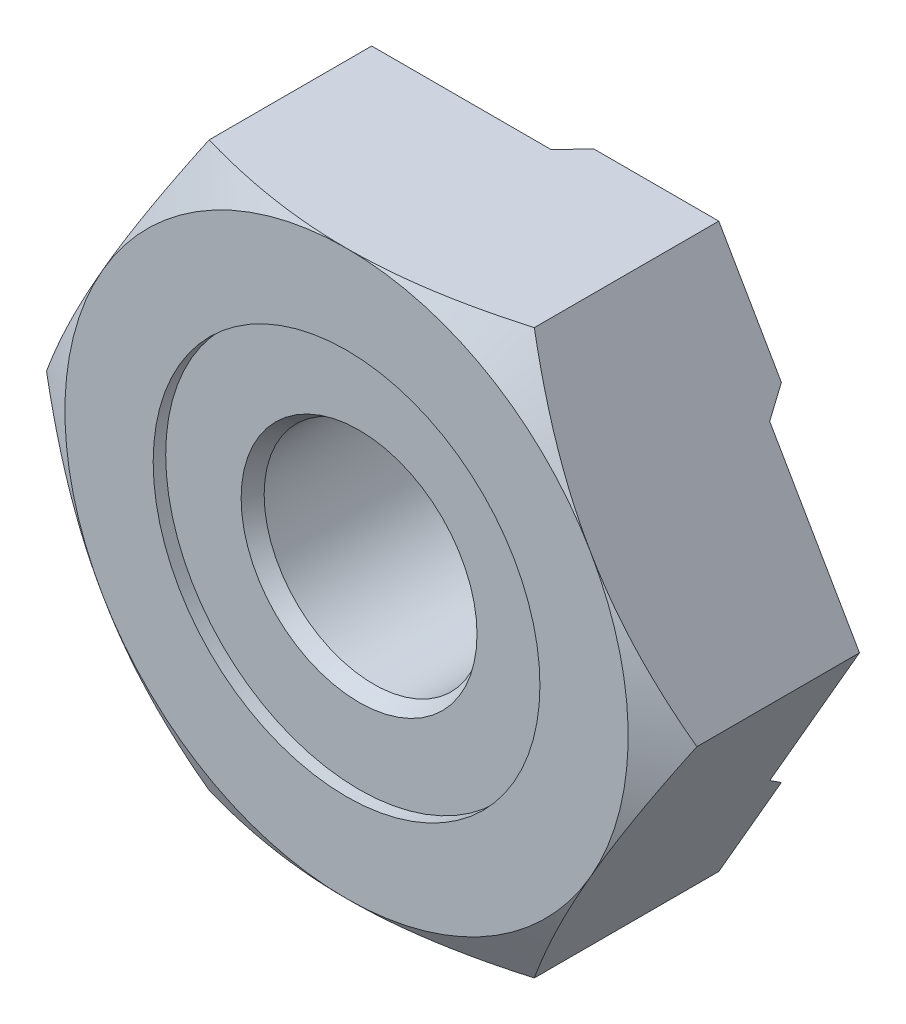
ISO-10303-21;
HEADER;
FILE_DESCRIPTION(('STEP AP214'),'2;1');
FILE_NAME('part.step','',(''),(''),'','','');
FILE_SCHEMA(('AUTOMOTIVE_DESIGN { 1 0 10303 214 1 1 1 1 }'));
ENDSEC;
DATA;
#1=APPLICATION_CONTEXT('core data for automotive mechanical design processes');
#2=APPLICATION_PROTOCOL_DEFINITION('international standard','automotive_design',2000,#1);
#3=PRODUCT_CONTEXT('',#1,'mechanical');
#4=PRODUCT('Part','Part','',(#3));
#5=PRODUCT_RELATED_PRODUCT_CATEGORY('part','',(#4));
#6=PRODUCT_DEFINITION_FORMATION('','',#4);
#7=PRODUCT_DEFINITION_CONTEXT('part definition',#1,'design');
#8=PRODUCT_DEFINITION('design','',#6,#7);
#9=PRODUCT_DEFINITION_SHAPE('','',#8);
#10=(LENGTH_UNIT() NAMED_UNIT(*) SI_UNIT(.MILLI.,.METRE.));
#11=(NAMED_UNIT(*) PLANE_ANGLE_UNIT() SI_UNIT($,.RADIAN.));
#12=(NAMED_UNIT(*) SI_UNIT($,.STERADIAN.) SOLID_ANGLE_UNIT());
#13=UNCERTAINTY_MEASURE_WITH_UNIT(LENGTH_MEASURE(1.E-05),#10,'distance_accuracy_value','');
#14=(GEOMETRIC_REPRESENTATION_CONTEXT(3) GLOBAL_UNCERTAINTY_ASSIGNED_CONTEXT((#13)) GLOBAL_UNIT_ASSIGNED_CONTEXT((#10,
#11,#12)) REPRESENTATION_CONTEXT('',''));
#15=CARTESIAN_POINT('',(0.,0.,0.));
#16=DIRECTION('',(0.,0.,1.));
#17=DIRECTION('',(1.,0.,0.));
#18=AXIS2_PLACEMENT_3D('',#15,#16,#17);
#19=CARTESIAN_POINT('',(0.,0.,-2.99999999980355));
#20=DIRECTION('',(0.,0.,-1.));
#21=DIRECTION('',(-1.,0.,0.));
#22=AXIS2_PLACEMENT_3D('',#19,#20,#21);
#23=PLANE('',#22);
#24=CARTESIAN_POINT('',(0.,0.,-2.99999999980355));
#25=DIRECTION('',(0.,0.,-1.));
#26=DIRECTION('',(-1.,0.,0.));
#27=AXIS2_PLACEMENT_3D('',#24,#25,#26);
#28=CIRCLE('',#27,2.985);
#29=CARTESIAN_POINT('',(-2.985,0.,-2.99999999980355));
#30=VERTEX_POINT('',#29);
#31=EDGE_CURVE('E330',#30,#30,#28,.T.);
#32=ORIENTED_EDGE('',*,*,#31,.F.);
#33=EDGE_LOOP('',(#32));
#34=FACE_BOUND('',#33,.T.);
#35=DIRECTION('',(0.5,-0.866025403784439,0.));
#36=VECTOR('',#35,1.);
#37=CARTESIAN_POINT('',(-5.19615242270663,0.,-2.99999999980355));
#38=LINE('',#37,#36);
#39=CARTESIAN_POINT('',(-4.03294474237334,-2.0147348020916,-2.99999999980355));
#40=VERTEX_POINT('',#39);
#41=CARTESIAN_POINT('',(-2.59807621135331,-4.5,-2.99999999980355));
#42=VERTEX_POINT('',#41);
#43=EDGE_CURVE('E320',#40,#42,#38,.T.);
#44=ORIENTED_EDGE('',*,*,#43,.F.);
#45=DIRECTION('',(0.,1.,0.));
#46=VECTOR('',#45,1.);
#47=CARTESIAN_POINT('',(-4.0329447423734,1.73205080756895,-2.99999999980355));
#48=LINE('',#47,#46);
#49=CARTESIAN_POINT('',(-4.0329447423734,2.01473480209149,-2.99999999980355));
#50=VERTEX_POINT('',#49);
#51=EDGE_CURVE('E90',#50,#40,#48,.F.);
#52=ORIENTED_EDGE('',*,*,#51,.F.);
#53=DIRECTION('',(-0.5,-0.866025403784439,0.));
#54=VECTOR('',#53,1.);
#55=CARTESIAN_POINT('',(-2.59807621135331,4.5,-2.99999999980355));
#56=LINE('',#55,#54);
#57=CARTESIAN_POINT('',(-2.59807621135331,4.5,-2.99999999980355));
#58=VERTEX_POINT('',#57);
#59=EDGE_CURVE('E316',#58,#50,#56,.T.);
#60=ORIENTED_EDGE('',*,*,#59,.F.);
#61=DIRECTION('',(-1.,0.,0.));
#62=VECTOR('',#61,1.);
#63=CARTESIAN_POINT('',(2.59807621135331,4.5,-2.99999999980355));
#64=LINE('',#63,#62);
#65=CARTESIAN_POINT('',(0.271660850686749,4.5,-2.99999999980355));
#66=VERTEX_POINT('',#65);
#67=EDGE_CURVE('E325',#66,#58,#64,.T.);
#68=ORIENTED_EDGE('',*,*,#67,.F.);
#69=DIRECTION('',(0.866025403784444,-0.499999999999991,0.));
#70=VECTOR('',#69,1.);
#71=CARTESIAN_POINT('',(3.51647237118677,2.62660719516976,-2.99999999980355));
#72=LINE('',#71,#70);
#73=CARTESIAN_POINT('',(3.76128389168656,2.48526519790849,-2.99999999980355));
#74=VERTEX_POINT('',#73);
#75=EDGE_CURVE('E349',#74,#66,#72,.F.);
#76=ORIENTED_EDGE('',*,*,#75,.F.);
#77=DIRECTION('',(-0.5,0.866025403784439,0.));
#78=VECTOR('',#77,1.);
#79=CARTESIAN_POINT('',(5.19615242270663,0.,-2.99999999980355));
#80=LINE('',#79,#78);
#81=CARTESIAN_POINT('',(5.19615242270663,0.,-2.99999999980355));
#82=VERTEX_POINT('',#81);
#83=EDGE_CURVE('E322',#82,#74,#80,.T.);
#84=ORIENTED_EDGE('',*,*,#83,.F.);
#85=DIRECTION('',(0.5,0.866025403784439,0.));
#86=VECTOR('',#85,1.);
#87=CARTESIAN_POINT('',(2.59807621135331,-4.5,-2.99999999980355));
#88=LINE('',#87,#86);
#89=CARTESIAN_POINT('',(3.76128389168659,-2.48526519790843,-2.99999999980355));
#90=VERTEX_POINT('',#89);
#91=EDGE_CURVE('E184',#90,#82,#88,.T.);
#92=ORIENTED_EDGE('',*,*,#91,.F.);
#93=DIRECTION('',(-0.866025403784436,-0.500000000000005,0.));
#94=VECTOR('',#93,1.);
#95=CARTESIAN_POINT('',(0.516472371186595,-4.35865800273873,-2.99999999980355));
#96=LINE('',#95,#94);
#97=CARTESIAN_POINT('',(0.271660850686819,-4.5,-2.99999999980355));
#98=VERTEX_POINT('',#97);
#99=EDGE_CURVE('E341',#98,#90,#96,.F.);
#100=ORIENTED_EDGE('',*,*,#99,.F.);
#101=DIRECTION('',(1.,0.,0.));
#102=VECTOR('',#101,1.);
#103=CARTESIAN_POINT('',(-2.59807621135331,-4.5,-2.99999999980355));
#104=LINE('',#103,#102);
#105=EDGE_CURVE('E315',#42,#98,#104,.T.);
#106=ORIENTED_EDGE('',*,*,#105,.F.);
#107=EDGE_LOOP('',(#44,#52,#60,#68,#76,#84,#92,#100,#106));
#108=FACE_BOUND('',#107,.T.);
#109=ADVANCED_FACE('F45',(#34,#108),#23,.T.);
#110=CARTESIAN_POINT('',(-2.59807621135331,-4.5,-3.5));
#111=DIRECTION('',(0.,-1.,0.));
#112=DIRECTION('',(0.,0.,-1.));
#113=AXIS2_PLACEMENT_3D('',#110,#111,#112);
#114=PLANE('',#113);
#115=DIRECTION('',(0.,0.,1.));
#116=VECTOR('',#115,1.);
#117=CARTESIAN_POINT('',(-2.59807621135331,-4.5,-3.5));
#118=LINE('',#117,#116);
#119=CARTESIAN_POINT('',(-2.59807621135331,-4.5,-0.401923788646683));
#120=VERTEX_POINT('',#119);
#121=EDGE_CURVE('E603',#42,#120,#118,.T.);
#122=ORIENTED_EDGE('',*,*,#121,.F.);
#123=ORIENTED_EDGE('',*,*,#105,.T.);
#124=DIRECTION('',(0.682037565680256,0.,-0.731317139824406));
#125=VECTOR('',#124,1.);
#126=CARTESIAN_POINT('',(-0.813876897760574,-4.5,-1.83602839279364));
#127=LINE('',#126,#125);
#128=CARTESIAN_POINT('',(0.598076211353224,-4.50000000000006,-3.34999999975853));
#129=VERTEX_POINT('',#128);
#130=EDGE_CURVE('E56',#129,#98,#127,.F.);
#131=ORIENTED_EDGE('',*,*,#130,.F.);
#132=DIRECTION('',(-1.,0.,0.));
#133=VECTOR('',#132,1.);
#134=CARTESIAN_POINT('',(2.59807621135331,-4.5,-3.34999999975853));
#135=LINE('',#134,#133);
#136=CARTESIAN_POINT('',(2.59807621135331,-4.5,-3.34999999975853));
#137=VERTEX_POINT('',#136);
#138=EDGE_CURVE('E338',#137,#129,#135,.T.);
#139=ORIENTED_EDGE('',*,*,#138,.F.);
#140=DIRECTION('',(0.,0.,1.));
#141=VECTOR('',#140,1.);
#142=CARTESIAN_POINT('',(2.59807621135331,-4.5,-3.5));
#143=LINE('',#142,#141);
#144=CARTESIAN_POINT('',(2.59807621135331,-4.5,-0.401923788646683));
#145=VERTEX_POINT('',#144);
#146=EDGE_CURVE('E192',#137,#145,#143,.T.);
#147=ORIENTED_EDGE('',*,*,#146,.T.);
#148=CARTESIAN_POINT('',(-6.89048098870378,-4.5,-2.1533701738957));
#149=CARTESIAN_POINT('',(-6.69290554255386,-4.5,-2.05789080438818));
#150=CARTESIAN_POINT('',(-6.49486296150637,-4.5,-1.96336057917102));
#151=CARTESIAN_POINT('',(-6.09759095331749,-4.5,-1.77674079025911));
#152=CARTESIAN_POINT('',(-5.89836132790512,-4.5,-1.68465164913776));
#153=CARTESIAN_POINT('',(-5.49738643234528,-4.5,-1.50297127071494));
#154=CARTESIAN_POINT('',(-5.29563329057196,-4.5,-1.41339734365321));
#155=CARTESIAN_POINT('',(-4.89046876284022,-4.5,-1.23809690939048));
#156=CARTESIAN_POINT('',(-4.6870574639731,-4.5,-1.15237020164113));
#157=CARTESIAN_POINT('',(-4.27572796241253,-4.5,-0.984769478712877));
#158=CARTESIAN_POINT('',(-4.06778508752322,-4.5,-0.902955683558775));
#159=CARTESIAN_POINT('',(-3.64944648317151,-4.5,-0.745735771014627));
#160=CARTESIAN_POINT('',(-3.43905048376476,-4.5,-0.670330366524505));
#161=CARTESIAN_POINT('',(-3.01590374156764,-4.5,-0.527953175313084));
#162=CARTESIAN_POINT('',(-2.80315909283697,-4.5,-0.460963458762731));
#163=CARTESIAN_POINT('',(-2.37464326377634,-4.5,-0.337593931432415));
#164=CARTESIAN_POINT('',(-2.15887306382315,-4.5,-0.28121076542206));
#165=CARTESIAN_POINT('',(-1.72416861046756,-4.5,-0.181789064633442));
#166=CARTESIAN_POINT('',(-1.50523353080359,-4.5,-0.138754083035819));
#167=CARTESIAN_POINT('',(-1.06469469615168,-4.5,-0.0689356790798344));
#168=CARTESIAN_POINT('',(-0.843090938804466,-4.5,-0.0421522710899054));
#169=CARTESIAN_POINT('',(-0.510328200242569,-4.5,-0.0158866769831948));
#170=CARTESIAN_POINT('',(-0.399692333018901,-4.5,-0.009448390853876));
#171=CARTESIAN_POINT('',(-0.178250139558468,-4.5,-0.00125420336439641));
#172=CARTESIAN_POINT('',(-0.067443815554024,-4.5,0.000501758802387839));
#173=CARTESIAN_POINT('',(0.264874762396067,-4.5,-0.00136481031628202));
#174=CARTESIAN_POINT('',(0.486392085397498,-4.5,-0.0121133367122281));
#175=CARTESIAN_POINT('',(0.864637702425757,-4.5,-0.0459870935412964));
#176=CARTESIAN_POINT('',(1.02179166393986,-4.5,-0.064697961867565));
#177=CARTESIAN_POINT('',(1.3348863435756,-4.5,-0.110491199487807));
#178=CARTESIAN_POINT('',(1.49082689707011,-4.5,-0.137574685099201));
#179=CARTESIAN_POINT('',(1.95670271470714,-4.5,-0.229966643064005));
#180=CARTESIAN_POINT('',(2.26445294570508,-4.5,-0.306392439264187));
#181=CARTESIAN_POINT('',(2.72495525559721,-4.5,-0.438205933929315));
#182=CARTESIAN_POINT('',(2.88010725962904,-4.5,-0.485678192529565));
#183=CARTESIAN_POINT('',(3.18879181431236,-4.5,-0.585320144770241));
#184=CARTESIAN_POINT('',(3.34232540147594,-4.5,-0.637486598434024));
#185=CARTESIAN_POINT('',(3.64713119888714,-4.5,-0.745431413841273));
#186=CARTESIAN_POINT('',(3.79841127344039,-4.5,-0.801187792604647));
#187=CARTESIAN_POINT('',(4.09979769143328,-4.5,-0.915973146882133));
#188=CARTESIAN_POINT('',(4.24990353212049,-4.5,-0.97500344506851));
#189=CARTESIAN_POINT('',(4.39946661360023,-4.5,-1.03534763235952));
#190=B_SPLINE_CURVE_WITH_KNOTS('',3,(#148,#149,#150,#151,#152,#153,#154,#155,#156,#157,#158,
#159,#160,#161,#162,#163,#164,#165,#166,#167,#168,#169,#170,#171,#172,#173,#174,#175,#176,#177,
#178,#179,#180,#181,#182,#183,#184,#185,#186,#187,#188,#189),.UNSPECIFIED.,.F.,.F.,(4,2,2,2,2,2,
2,2,2,2,2,2,2,2,2,2,2,2,2,2,4),(0.,0.658318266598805,1.31674975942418,1.97894918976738,
2.6411140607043,3.31140826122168,3.98177693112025,4.650692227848,5.31939556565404,
5.98827675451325,6.65715853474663,6.9895387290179,7.32191460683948,7.98634999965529,
8.46092050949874,8.93555432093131,9.88553991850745,10.3722575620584,10.8586418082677,
11.3422883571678,11.8261317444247),.UNSPECIFIED.);
#191=CARTESIAN_POINT('',(0.,-4.5,0.));
#192=VERTEX_POINT('',#191);
#193=EDGE_CURVE('E175',#192,#145,#190,.T.);
#194=ORIENTED_EDGE('',*,*,#193,.F.);
#195=EDGE_CURVE('E158',#120,#192,#190,.T.);
#196=ORIENTED_EDGE('',*,*,#195,.F.);
#197=EDGE_LOOP('',(#122,#123,#131,#139,#147,#194,#196));
#198=FACE_BOUND('',#197,.T.);
#199=ADVANCED_FACE('F195',(#198),#114,.T.);
#200=CARTESIAN_POINT('',(-5.19615242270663,0.,-3.5));
#201=DIRECTION('',(-0.866025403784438,-0.5,0.));
#202=DIRECTION('',(0.5,-0.866025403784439,0.));
#203=AXIS2_PLACEMENT_3D('',#200,#201,#202);
#204=PLANE('',#203);
#205=DIRECTION('',(0.,0.,1.));
#206=VECTOR('',#205,1.);
#207=CARTESIAN_POINT('',(-5.19615242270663,0.,-3.5));
#208=LINE('',#207,#206);
#209=CARTESIAN_POINT('',(-5.19615242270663,0.,-3.34999999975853));
#210=VERTEX_POINT('',#209);
#211=CARTESIAN_POINT('',(-5.19615242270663,0.,-0.401923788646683));
#212=VERTEX_POINT('',#211);
#213=EDGE_CURVE('E96',#210,#212,#208,.T.);
#214=ORIENTED_EDGE('',*,*,#213,.F.);
#215=DIRECTION('',(-0.499999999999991,0.866025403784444,0.));
#216=VECTOR('',#215,1.);
#217=CARTESIAN_POINT('',(-4.1961524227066,-1.73205080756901,-3.34999999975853));
#218=LINE('',#217,#216);
#219=CARTESIAN_POINT('',(-4.1961524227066,-1.73205080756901,-3.34999999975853));
#220=VERTEX_POINT('',#219);
#221=EDGE_CURVE('E357',#220,#210,#218,.T.);
#222=ORIENTED_EDGE('',*,*,#221,.F.);
#223=DIRECTION('',(-0.341018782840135,0.590661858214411,-0.731317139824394));
#224=VECTOR('',#223,1.);
#225=CARTESIAN_POINT('',(-4.89391528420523,-0.523490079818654,-4.84635728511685));
#226=LINE('',#225,#224);
#227=EDGE_CURVE('E352',#220,#40,#226,.F.);
#228=ORIENTED_EDGE('',*,*,#227,.T.);
#229=ORIENTED_EDGE('',*,*,#43,.T.);
#230=ORIENTED_EDGE('',*,*,#121,.T.);
#231=CARTESIAN_POINT('',(-5.19626789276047,0.000200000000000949,-0.401990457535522));
#232=CARTESIAN_POINT('',(-5.08209622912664,-0.197551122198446,-0.336049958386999));
#233=CARTESIAN_POINT('',(-4.96693904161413,-0.397009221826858,-0.276079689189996));
#234=CARTESIAN_POINT('',(-4.73463063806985,-0.799379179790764,-0.171401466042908));
#235=CARTESIAN_POINT('',(-4.61747529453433,-1.00229818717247,-0.126730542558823));
#236=CARTESIAN_POINT('',(-4.38461651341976,-1.40562142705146,-0.0571944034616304));
#237=CARTESIAN_POINT('',(-4.26894890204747,-1.6059636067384,-0.0318663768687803));
#238=CARTESIAN_POINT('',(-4.03706947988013,-2.00759054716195,-0.00163111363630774));
#239=CARTESIAN_POINT('',(-3.92085851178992,-2.20887384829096,0.00330116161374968));
#240=CARTESIAN_POINT('',(-3.70371556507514,-2.58497646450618,-0.00696484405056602));
#241=CARTESIAN_POINT('',(-3.60275106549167,-2.75985210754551,-0.0196424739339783));
#242=CARTESIAN_POINT('',(-3.40147984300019,-3.10846409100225,-0.0598215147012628));
#243=CARTESIAN_POINT('',(-3.30117381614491,-3.28219922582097,-0.0873366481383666));
#244=CARTESIAN_POINT('',(-3.09948767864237,-3.63152986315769,-0.156121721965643));
#245=CARTESIAN_POINT('',(-2.99813309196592,-3.80708115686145,-0.197683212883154));
#246=CARTESIAN_POINT('',(-2.79693551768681,-4.15556557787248,-0.292011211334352));
#247=CARTESIAN_POINT('',(-2.6970899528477,-4.32850316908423,-0.344755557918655));
#248=CARTESIAN_POINT('',(-2.59796074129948,-4.5002,-0.401990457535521));
#249=B_SPLINE_CURVE_WITH_KNOTS('',3,(#231,#232,#233,#234,#235,#236,#237,#238,#239,#240,#241,
#242,#243,#244,#245,#246,#247,#248),.UNSPECIFIED.,.F.,.F.,(4,2,2,2,2,2,2,2,4),(0.,
0.713301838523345,1.42831814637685,2.12563847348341,2.82210248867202,3.42850519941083,
4.03546970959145,4.65589693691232,5.27510597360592),.UNSPECIFIED.);
#250=CARTESIAN_POINT('',(-3.89711431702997,-2.25,0.));
#251=VERTEX_POINT('',#250);
#252=EDGE_CURVE('E170',#251,#120,#249,.T.);
#253=ORIENTED_EDGE('',*,*,#252,.F.);
#254=EDGE_CURVE('E253',#212,#251,#249,.T.);
#255=ORIENTED_EDGE('',*,*,#254,.F.);
#256=EDGE_LOOP('',(#214,#222,#228,#229,#230,#253,#255));
#257=FACE_BOUND('',#256,.T.);
#258=ADVANCED_FACE('F260',(#257),#204,.T.);
#259=CARTESIAN_POINT('',(-2.59807621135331,4.5,-3.5));
#260=DIRECTION('',(-0.866025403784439,0.5,0.));
#261=DIRECTION('',(-0.5,-0.866025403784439,0.));
#262=AXIS2_PLACEMENT_3D('',#259,#260,#261);
#263=PLANE('',#262);
#264=DIRECTION('',(0.,0.,1.));
#265=VECTOR('',#264,1.);
#266=CARTESIAN_POINT('',(-2.59807621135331,4.5,-3.5));
#267=LINE('',#266,#265);
#268=CARTESIAN_POINT('',(-2.59807621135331,4.5,-0.401923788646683));
#269=VERTEX_POINT('',#268);
#270=EDGE_CURVE('E597',#58,#269,#267,.T.);
#271=ORIENTED_EDGE('',*,*,#270,.F.);
#272=ORIENTED_EDGE('',*,*,#59,.T.);
#273=DIRECTION('',(-0.341018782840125,-0.590661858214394,-0.731317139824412));
#274=VECTOR('',#273,1.);
#275=CARTESIAN_POINT('',(-3.49017586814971,2.95483806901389,-1.83602839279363));
#276=LINE('',#275,#274);
#277=CARTESIAN_POINT('',(-4.19615242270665,1.73205080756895,-3.34999999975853));
#278=VERTEX_POINT('',#277);
#279=EDGE_CURVE('E81',#278,#50,#276,.F.);
#280=ORIENTED_EDGE('',*,*,#279,.F.);
#281=DIRECTION('',(0.499999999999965,0.866025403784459,0.));
#282=VECTOR('',#281,1.);
#283=CARTESIAN_POINT('',(-5.19615242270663,0.,-3.34999999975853));
#284=LINE('',#283,#282);
#285=EDGE_CURVE('E353',#210,#278,#284,.T.);
#286=ORIENTED_EDGE('',*,*,#285,.F.);
#287=ORIENTED_EDGE('',*,*,#213,.T.);
#288=CARTESIAN_POINT('',(-2.59796074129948,4.5002,-0.401990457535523));
#289=CARTESIAN_POINT('',(-2.7121324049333,4.30244887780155,-0.336049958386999));
#290=CARTESIAN_POINT('',(-2.82728959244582,4.10299077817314,-0.276079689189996));
#291=CARTESIAN_POINT('',(-3.0595979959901,3.70062082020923,-0.171401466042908));
#292=CARTESIAN_POINT('',(-3.17675333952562,3.49770181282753,-0.126730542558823));
#293=CARTESIAN_POINT('',(-3.40961212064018,3.09437857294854,-0.0571944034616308));
#294=CARTESIAN_POINT('',(-3.52527973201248,2.89403639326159,-0.0318663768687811));
#295=CARTESIAN_POINT('',(-3.75715915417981,2.49240945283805,-0.00163111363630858));
#296=CARTESIAN_POINT('',(-3.87337012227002,2.29112615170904,0.00330116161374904));
#297=CARTESIAN_POINT('',(-4.09051306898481,1.91502353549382,-0.00696484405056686));
#298=CARTESIAN_POINT('',(-4.19147756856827,1.74014789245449,-0.0196424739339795));
#299=CARTESIAN_POINT('',(-4.39274879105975,1.39153590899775,-0.0598215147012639));
#300=CARTESIAN_POINT('',(-4.49305481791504,1.21780077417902,-0.0873366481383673));
#301=CARTESIAN_POINT('',(-4.69474095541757,0.868470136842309,-0.156121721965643));
#302=CARTESIAN_POINT('',(-4.79609554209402,0.69291884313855,-0.197683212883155));
#303=CARTESIAN_POINT('',(-4.99729311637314,0.344434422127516,-0.292011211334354));
#304=CARTESIAN_POINT('',(-5.09713868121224,0.17149683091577,-0.344755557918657));
#305=CARTESIAN_POINT('',(-5.19626789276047,-0.000199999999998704,-0.401990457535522));
#306=B_SPLINE_CURVE_WITH_KNOTS('',3,(#288,#289,#290,#291,#292,#293,#294,#295,#296,#297,#298,
#299,#300,#301,#302,#303,#304,#305),.UNSPECIFIED.,.F.,.F.,(4,2,2,2,2,2,2,2,4),(0.,
0.713301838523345,1.42831814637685,2.12563847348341,2.82210248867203,3.42850519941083,
4.03546970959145,4.65589693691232,5.27510597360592),.UNSPECIFIED.);
#307=CARTESIAN_POINT('',(-3.89711431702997,2.25,0.));
#308=VERTEX_POINT('',#307);
#309=EDGE_CURVE('E255',#308,#212,#306,.T.);
#310=ORIENTED_EDGE('',*,*,#309,.F.);
#311=EDGE_CURVE('E596',#269,#308,#306,.T.);
#312=ORIENTED_EDGE('',*,*,#311,.F.);
#313=EDGE_LOOP('',(#271,#272,#280,#286,#287,#310,#312));
#314=FACE_BOUND('',#313,.T.);
#315=ADVANCED_FACE('F265',(#314),#263,.T.);
#316=CARTESIAN_POINT('',(2.59807621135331,4.5,-3.5));
#317=DIRECTION('',(0.,1.,0.));
#318=DIRECTION('',(0.,0.,1.));
#319=AXIS2_PLACEMENT_3D('',#316,#317,#318);
#320=PLANE('',#319);
#321=DIRECTION('',(0.,0.,1.));
#322=VECTOR('',#321,1.);
#323=CARTESIAN_POINT('',(2.59807621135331,4.5,-3.5));
#324=LINE('',#323,#322);
#325=CARTESIAN_POINT('',(2.59807621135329,4.50000000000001,-3.34999999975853));
#326=VERTEX_POINT('',#325);
#327=CARTESIAN_POINT('',(2.59807621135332,4.5,-0.401923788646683));
#328=VERTEX_POINT('',#327);
#329=EDGE_CURVE('E610',#326,#328,#324,.T.);
#330=ORIENTED_EDGE('',*,*,#329,.F.);
#331=DIRECTION('',(1.,0.,0.));
#332=VECTOR('',#331,1.);
#333=CARTESIAN_POINT('',(0.598076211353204,4.50000000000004,-3.34999999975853));
#334=LINE('',#333,#332);
#335=CARTESIAN_POINT('',(0.598076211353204,4.50000000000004,-3.34999999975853));
#336=VERTEX_POINT('',#335);
#337=EDGE_CURVE('E350',#336,#326,#334,.T.);
#338=ORIENTED_EDGE('',*,*,#337,.F.);
#339=DIRECTION('',(0.682037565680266,0.,-0.731317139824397));
#340=VECTOR('',#339,1.);
#341=CARTESIAN_POINT('',(1.99360193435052,4.5,-4.84635728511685));
#342=LINE('',#341,#340);
#343=EDGE_CURVE('E342',#336,#66,#342,.F.);
#344=ORIENTED_EDGE('',*,*,#343,.T.);
#345=ORIENTED_EDGE('',*,*,#67,.T.);
#346=ORIENTED_EDGE('',*,*,#270,.T.);
#347=CARTESIAN_POINT('',(-6.89048098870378,4.5,-2.15337017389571));
#348=CARTESIAN_POINT('',(-6.69290554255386,4.5,-2.05789080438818));
#349=CARTESIAN_POINT('',(-6.49486296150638,4.5,-1.96336057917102));
#350=CARTESIAN_POINT('',(-6.09759095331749,4.5,-1.77674079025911));
#351=CARTESIAN_POINT('',(-5.89836132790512,4.5,-1.68465164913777));
#352=CARTESIAN_POINT('',(-5.49738643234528,4.5,-1.50297127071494));
#353=CARTESIAN_POINT('',(-5.29563329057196,4.5,-1.41339734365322));
#354=CARTESIAN_POINT('',(-4.89046876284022,4.5,-1.23809690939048));
#355=CARTESIAN_POINT('',(-4.6870574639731,4.5,-1.15237020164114));
#356=CARTESIAN_POINT('',(-4.27572796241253,4.5,-0.984769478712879));
#357=CARTESIAN_POINT('',(-4.06778508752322,4.5,-0.902955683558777));
#358=CARTESIAN_POINT('',(-3.64944648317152,4.5,-0.745735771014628));
#359=CARTESIAN_POINT('',(-3.43905048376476,4.5,-0.670330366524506));
#360=CARTESIAN_POINT('',(-3.01590374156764,4.5,-0.527953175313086));
#361=CARTESIAN_POINT('',(-2.80315909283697,4.5,-0.460963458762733));
#362=CARTESIAN_POINT('',(-2.37464326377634,4.5,-0.337593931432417));
#363=CARTESIAN_POINT('',(-2.15887306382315,4.5,-0.281210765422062));
#364=CARTESIAN_POINT('',(-1.72416861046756,4.5,-0.181789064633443));
#365=CARTESIAN_POINT('',(-1.50523353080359,4.5,-0.13875408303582));
#366=CARTESIAN_POINT('',(-1.06469469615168,4.5,-0.0689356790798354));
#367=CARTESIAN_POINT('',(-0.843090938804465,4.5,-0.0421522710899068));
#368=CARTESIAN_POINT('',(-0.510328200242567,4.5,-0.0158866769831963));
#369=CARTESIAN_POINT('',(-0.3996923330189,4.5,-0.00944839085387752));
#370=CARTESIAN_POINT('',(-0.178250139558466,4.5,-0.00125420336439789));
#371=CARTESIAN_POINT('',(-0.0674438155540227,4.5,0.000501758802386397));
#372=CARTESIAN_POINT('',(0.264874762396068,4.5,-0.00136481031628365));
#373=CARTESIAN_POINT('',(0.4863920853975,4.5,-0.0121133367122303));
#374=CARTESIAN_POINT('',(0.864637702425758,4.5,-0.0459870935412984));
#375=CARTESIAN_POINT('',(1.02179166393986,4.5,-0.0646979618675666));
#376=CARTESIAN_POINT('',(1.3348863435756,4.5,-0.110491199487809));
#377=CARTESIAN_POINT('',(1.49082689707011,4.5,-0.137574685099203));
#378=CARTESIAN_POINT('',(1.95670271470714,4.5,-0.229966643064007));
#379=CARTESIAN_POINT('',(2.26445294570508,4.5,-0.306392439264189));
#380=CARTESIAN_POINT('',(2.72495525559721,4.5,-0.438205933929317));
#381=CARTESIAN_POINT('',(2.88010725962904,4.5,-0.485678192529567));
#382=CARTESIAN_POINT('',(3.18879181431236,4.5,-0.585320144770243));
#383=CARTESIAN_POINT('',(3.34232540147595,4.5,-0.637486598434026));
#384=CARTESIAN_POINT('',(3.64713119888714,4.5,-0.745431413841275));
#385=CARTESIAN_POINT('',(3.79841127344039,4.5,-0.801187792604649));
#386=CARTESIAN_POINT('',(4.09979769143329,4.5,-0.915973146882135));
#387=CARTESIAN_POINT('',(4.24990353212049,4.5,-0.975003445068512));
#388=CARTESIAN_POINT('',(4.39946661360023,4.5,-1.03534763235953));
#389=B_SPLINE_CURVE_WITH_KNOTS('',3,(#347,#348,#349,#350,#351,#352,#353,#354,#355,#356,#357,
#358,#359,#360,#361,#362,#363,#364,#365,#366,#367,#368,#369,#370,#371,#372,#373,#374,#375,#376,
#377,#378,#379,#380,#381,#382,#383,#384,#385,#386,#387,#388),.UNSPECIFIED.,.F.,.F.,(4,2,2,2,2,2,
2,2,2,2,2,2,2,2,2,2,2,2,2,2,4),(0.,0.658318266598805,1.31674975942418,1.97894918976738,
2.6411140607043,3.31140826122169,3.98177693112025,4.650692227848,5.31939556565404,
5.98827675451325,6.65715853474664,6.9895387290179,7.32191460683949,7.9863499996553,
8.46092050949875,8.93555432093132,9.88553991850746,10.3722575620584,10.8586418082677,
11.3422883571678,11.8261317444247),.UNSPECIFIED.);
#390=CARTESIAN_POINT('',(0.,4.5,0.));
#391=VERTEX_POINT('',#390);
#392=EDGE_CURVE('E594',#391,#269,#389,.F.);
#393=ORIENTED_EDGE('',*,*,#392,.F.);
#394=EDGE_CURVE('E212',#328,#391,#389,.F.);
#395=ORIENTED_EDGE('',*,*,#394,.F.);
#396=EDGE_LOOP('',(#330,#338,#344,#345,#346,#393,#395));
#397=FACE_BOUND('',#396,.T.);
#398=ADVANCED_FACE('F262',(#397),#320,.T.);
#399=CARTESIAN_POINT('',(5.19615242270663,0.,-3.5));
#400=DIRECTION('',(0.866025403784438,0.5,0.));
#401=DIRECTION('',(-0.5,0.866025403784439,0.));
#402=AXIS2_PLACEMENT_3D('',#399,#400,#401);
#403=PLANE('',#402);
#404=DIRECTION('',(0.,0.,1.));
#405=VECTOR('',#404,1.);
#406=CARTESIAN_POINT('',(5.19615242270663,0.,-3.5));
#407=LINE('',#406,#405);
#408=CARTESIAN_POINT('',(5.19615242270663,0.,-0.401923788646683));
#409=VERTEX_POINT('',#408);
#410=EDGE_CURVE('E609',#82,#409,#407,.T.);
#411=ORIENTED_EDGE('',*,*,#410,.F.);
#412=ORIENTED_EDGE('',*,*,#83,.T.);
#413=DIRECTION('',(-0.341018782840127,0.590661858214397,-0.731317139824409));
#414=VECTOR('',#413,1.);
#415=CARTESIAN_POINT('',(4.30405276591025,1.54516193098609,-1.83602839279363));
#416=LINE('',#415,#414);
#417=CARTESIAN_POINT('',(3.5980762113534,2.76794919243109,-3.34999999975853));
#418=VERTEX_POINT('',#417);
#419=EDGE_CURVE('E611',#418,#74,#416,.F.);
#420=ORIENTED_EDGE('',*,*,#419,.F.);
#421=DIRECTION('',(0.500000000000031,-0.866025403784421,0.));
#422=VECTOR('',#421,1.);
#423=CARTESIAN_POINT('',(2.59807621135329,4.50000000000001,-3.34999999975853));
#424=LINE('',#423,#422);
#425=EDGE_CURVE('E344',#326,#418,#424,.T.);
#426=ORIENTED_EDGE('',*,*,#425,.F.);
#427=ORIENTED_EDGE('',*,*,#329,.T.);
#428=CARTESIAN_POINT('',(5.19626789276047,-0.000199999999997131,-0.401990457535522));
#429=CARTESIAN_POINT('',(5.08209622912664,0.19755112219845,-0.336049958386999));
#430=CARTESIAN_POINT('',(4.96693904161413,0.397009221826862,-0.276079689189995));
#431=CARTESIAN_POINT('',(4.73463063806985,0.799379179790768,-0.171401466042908));
#432=CARTESIAN_POINT('',(4.61747529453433,1.00229818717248,-0.126730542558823));
#433=CARTESIAN_POINT('',(4.38461651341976,1.40562142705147,-0.0571944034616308));
#434=CARTESIAN_POINT('',(4.26894890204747,1.60596360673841,-0.0318663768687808));
#435=CARTESIAN_POINT('',(4.03706947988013,2.00759054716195,-0.00163111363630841));
#436=CARTESIAN_POINT('',(3.92085851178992,2.20887384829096,0.00330116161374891));
#437=CARTESIAN_POINT('',(3.70371556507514,2.58497646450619,-0.00696484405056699));
#438=CARTESIAN_POINT('',(3.60275106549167,2.75985210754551,-0.0196424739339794));
#439=CARTESIAN_POINT('',(3.40147984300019,3.10846409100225,-0.059821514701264));
#440=CARTESIAN_POINT('',(3.30117381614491,3.28219922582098,-0.0873366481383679));
#441=CARTESIAN_POINT('',(3.09948767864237,3.63152986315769,-0.156121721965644));
#442=CARTESIAN_POINT('',(2.99813309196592,3.80708115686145,-0.197683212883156));
#443=CARTESIAN_POINT('',(2.79693551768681,4.15556557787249,-0.292011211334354));
#444=CARTESIAN_POINT('',(2.6970899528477,4.32850316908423,-0.344755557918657));
#445=CARTESIAN_POINT('',(2.59796074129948,4.5002,-0.401990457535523));
#446=B_SPLINE_CURVE_WITH_KNOTS('',3,(#428,#429,#430,#431,#432,#433,#434,#435,#436,#437,#438,
#439,#440,#441,#442,#443,#444,#445),.UNSPECIFIED.,.F.,.F.,(4,2,2,2,2,2,2,2,4),(0.,
0.713301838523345,1.42831814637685,2.12563847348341,2.82210248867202,3.42850519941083,
4.03546970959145,4.65589693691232,5.27510597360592),.UNSPECIFIED.);
#447=CARTESIAN_POINT('',(3.89711431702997,2.25,0.));
#448=VERTEX_POINT('',#447);
#449=EDGE_CURVE('E171',#448,#328,#446,.T.);
#450=ORIENTED_EDGE('',*,*,#449,.F.);
#451=EDGE_CURVE('E194',#409,#448,#446,.T.);
#452=ORIENTED_EDGE('',*,*,#451,.F.);
#453=EDGE_LOOP('',(#411,#412,#420,#426,#427,#450,#452));
#454=FACE_BOUND('',#453,.T.);
#455=ADVANCED_FACE('F267',(#454),#403,.T.);
#456=CARTESIAN_POINT('',(2.59807621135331,-4.5,-3.5));
#457=DIRECTION('',(0.866025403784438,-0.5,0.));
#458=DIRECTION('',(0.5,0.866025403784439,0.));
#459=AXIS2_PLACEMENT_3D('',#456,#457,#458);
#460=PLANE('',#459);
#461=ORIENTED_EDGE('',*,*,#146,.F.);
#462=DIRECTION('',(-0.500000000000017,-0.866025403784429,0.));
#463=VECTOR('',#462,1.);
#464=CARTESIAN_POINT('',(3.59807621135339,-2.76794919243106,-3.34999999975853));
#465=LINE('',#464,#463);
#466=CARTESIAN_POINT('',(3.59807621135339,-2.76794919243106,-3.34999999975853));
#467=VERTEX_POINT('',#466);
#468=EDGE_CURVE('E336',#467,#137,#465,.T.);
#469=ORIENTED_EDGE('',*,*,#468,.F.);
#470=DIRECTION('',(-0.341018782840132,-0.590661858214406,-0.731317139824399));
#471=VECTOR('',#470,1.);
#472=CARTESIAN_POINT('',(2.90031334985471,-3.97650992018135,-4.84635728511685));
#473=LINE('',#472,#471);
#474=EDGE_CURVE('E334',#467,#90,#473,.F.);
#475=ORIENTED_EDGE('',*,*,#474,.T.);
#476=ORIENTED_EDGE('',*,*,#91,.T.);
#477=ORIENTED_EDGE('',*,*,#410,.T.);
#478=CARTESIAN_POINT('',(2.59796074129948,-4.5002,-0.401990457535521));
#479=CARTESIAN_POINT('',(2.7121324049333,-4.30244887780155,-0.336049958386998));
#480=CARTESIAN_POINT('',(2.82728959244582,-4.10299077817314,-0.276079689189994));
#481=CARTESIAN_POINT('',(3.05959799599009,-3.70062082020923,-0.171401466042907));
#482=CARTESIAN_POINT('',(3.17675333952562,-3.49770181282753,-0.126730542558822));
#483=CARTESIAN_POINT('',(3.40961212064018,-3.09437857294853,-0.0571944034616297));
#484=CARTESIAN_POINT('',(3.52527973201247,-2.89403639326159,-0.0318663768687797));
#485=CARTESIAN_POINT('',(3.75715915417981,-2.49240945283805,-0.00163111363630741));
#486=CARTESIAN_POINT('',(3.87337012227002,-2.29112615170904,0.00330116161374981));
#487=CARTESIAN_POINT('',(4.09051306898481,-1.91502353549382,-0.00696484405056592));
#488=CARTESIAN_POINT('',(4.19147756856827,-1.74014789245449,-0.0196424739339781));
#489=CARTESIAN_POINT('',(4.39274879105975,-1.39153590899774,-0.0598215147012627));
#490=CARTESIAN_POINT('',(4.49305481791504,-1.21780077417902,-0.0873366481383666));
#491=CARTESIAN_POINT('',(4.69474095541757,-0.868470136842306,-0.156121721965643));
#492=CARTESIAN_POINT('',(4.79609554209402,-0.692918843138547,-0.197683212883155));
#493=CARTESIAN_POINT('',(4.99729311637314,-0.344434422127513,-0.292011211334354));
#494=CARTESIAN_POINT('',(5.09713868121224,-0.171496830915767,-0.344755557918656));
#495=CARTESIAN_POINT('',(5.19626789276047,0.000200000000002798,-0.401990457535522));
#496=B_SPLINE_CURVE_WITH_KNOTS('',3,(#478,#479,#480,#481,#482,#483,#484,#485,#486,#487,#488,
#489,#490,#491,#492,#493,#494,#495),.UNSPECIFIED.,.F.,.F.,(4,2,2,2,2,2,2,2,4),(0.,
0.713301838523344,1.42831814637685,2.12563847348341,2.82210248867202,3.42850519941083,
4.03546970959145,4.65589693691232,5.27510597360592),.UNSPECIFIED.);
#497=CARTESIAN_POINT('',(3.89711431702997,-2.25,0.));
#498=VERTEX_POINT('',#497);
#499=EDGE_CURVE('E237',#498,#409,#496,.T.);
#500=ORIENTED_EDGE('',*,*,#499,.F.);
#501=EDGE_CURVE('E177',#145,#498,#496,.T.);
#502=ORIENTED_EDGE('',*,*,#501,.F.);
#503=EDGE_LOOP('',(#461,#469,#475,#476,#477,#500,#502));
#504=FACE_BOUND('',#503,.T.);
#505=ADVANCED_FACE('F230',(#504),#460,.T.);
#506=CARTESIAN_POINT('',(0.,0.,0.));
#507=DIRECTION('',(0.,0.,-1.));
#508=DIRECTION('',(-1.,0.,0.));
#509=AXIS2_PLACEMENT_3D('',#506,#507,#508);
#510=CONICAL_SURFACE('',#509,4.5,1.0471975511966);
#511=ORIENTED_EDGE('',*,*,#451,.T.);
#512=CARTESIAN_POINT('',(0.,0.,0.));
#513=DIRECTION('',(0.,0.,1.));
#514=DIRECTION('',(1.,0.,0.));
#515=AXIS2_PLACEMENT_3D('',#512,#513,#514);
#516=CIRCLE('',#515,4.5);
#517=EDGE_CURVE('E190',#448,#498,#516,.F.);
#518=ORIENTED_EDGE('',*,*,#517,.T.);
#519=ORIENTED_EDGE('',*,*,#499,.T.);
#520=EDGE_LOOP('',(#511,#518,#519));
#521=FACE_BOUND('',#520,.T.);
#522=ADVANCED_FACE('F221',(#521),#510,.T.);
#523=ORIENTED_EDGE('',*,*,#394,.T.);
#524=EDGE_CURVE('E588',#391,#448,#516,.F.);
#525=ORIENTED_EDGE('',*,*,#524,.T.);
#526=ORIENTED_EDGE('',*,*,#449,.T.);
#527=EDGE_LOOP('',(#523,#525,#526));
#528=FACE_BOUND('',#527,.T.);
#529=ADVANCED_FACE('F228',(#528),#510,.T.);
#530=ORIENTED_EDGE('',*,*,#311,.T.);
#531=CARTESIAN_POINT('',(0.,0.,0.));
#532=DIRECTION('',(0.,0.,-1.));
#533=DIRECTION('',(-1.,0.,0.));
#534=AXIS2_PLACEMENT_3D('',#531,#532,#533);
#535=CIRCLE('',#534,4.5);
#536=EDGE_CURVE('E309',#308,#391,#535,.T.);
#537=ORIENTED_EDGE('',*,*,#536,.T.);
#538=ORIENTED_EDGE('',*,*,#392,.T.);
#539=EDGE_LOOP('',(#530,#537,#538));
#540=FACE_BOUND('',#539,.T.);
#541=ADVANCED_FACE('F229',(#540),#510,.T.);
#542=ORIENTED_EDGE('',*,*,#309,.T.);
#543=ORIENTED_EDGE('',*,*,#254,.T.);
#544=EDGE_CURVE('E191',#251,#308,#516,.F.);
#545=ORIENTED_EDGE('',*,*,#544,.T.);
#546=EDGE_LOOP('',(#542,#543,#545));
#547=FACE_BOUND('',#546,.T.);
#548=ADVANCED_FACE('F546',(#547),#510,.T.);
#549=ORIENTED_EDGE('',*,*,#252,.T.);
#550=ORIENTED_EDGE('',*,*,#195,.T.);
#551=EDGE_CURVE('E161',#192,#251,#516,.F.);
#552=ORIENTED_EDGE('',*,*,#551,.T.);
#553=EDGE_LOOP('',(#549,#550,#552));
#554=FACE_BOUND('',#553,.T.);
#555=ADVANCED_FACE('F165',(#554),#510,.T.);
#556=ORIENTED_EDGE('',*,*,#193,.T.);
#557=ORIENTED_EDGE('',*,*,#501,.T.);
#558=EDGE_CURVE('E180',#498,#192,#516,.F.);
#559=ORIENTED_EDGE('',*,*,#558,.T.);
#560=EDGE_LOOP('',(#556,#557,#559));
#561=FACE_BOUND('',#560,.T.);
#562=ADVANCED_FACE('F176',(#561),#510,.T.);
#563=CARTESIAN_POINT('',(2.59807621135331,-4.5,0.));
#564=DIRECTION('',(0.,0.,1.));
#565=DIRECTION('',(1.,0.,0.));
#566=AXIS2_PLACEMENT_3D('',#563,#564,#565);
#567=PLANE('',#566);
#568=CARTESIAN_POINT('',(0.,0.,0.));
#569=DIRECTION('',(0.,0.,-1.));
#570=DIRECTION('',(-1.,0.,0.));
#571=AXIS2_PLACEMENT_3D('',#568,#569,#570);
#572=CIRCLE('',#571,3.09);
#573=CARTESIAN_POINT('',(-3.09,0.,0.));
#574=VERTEX_POINT('',#573);
#575=EDGE_CURVE('E304',#574,#574,#572,.T.);
#576=ORIENTED_EDGE('',*,*,#575,.T.);
#577=EDGE_LOOP('',(#576));
#578=FACE_BOUND('',#577,.T.);
#579=ORIENTED_EDGE('',*,*,#558,.F.);
#580=ORIENTED_EDGE('',*,*,#517,.F.);
#581=ORIENTED_EDGE('',*,*,#524,.F.);
#582=ORIENTED_EDGE('',*,*,#536,.F.);
#583=ORIENTED_EDGE('',*,*,#544,.F.);
#584=ORIENTED_EDGE('',*,*,#551,.F.);
#585=EDGE_LOOP('',(#579,#580,#581,#582,#583,#584));
#586=FACE_BOUND('',#585,.T.);
#587=ADVANCED_FACE('F186',(#578,#586),#567,.T.);
#588=CARTESIAN_POINT('',(0.,0.,-0.200000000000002));
#589=DIRECTION('',(0.,0.,-1.));
#590=DIRECTION('',(-1.,0.,0.));
#591=AXIS2_PLACEMENT_3D('',#588,#589,#590);
#592=PLANE('',#591);
#593=CARTESIAN_POINT('',(0.,0.,-0.200000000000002));
#594=DIRECTION('',(0.,0.,-1.));
#595=DIRECTION('',(-1.,0.,0.));
#596=AXIS2_PLACEMENT_3D('',#593,#594,#595);
#597=CIRCLE('',#596,1.8847150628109);
#598=CARTESIAN_POINT('',(-1.8847150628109,0.,-0.200000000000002));
#599=VERTEX_POINT('',#598);
#600=EDGE_CURVE('E12',#599,#599,#597,.T.);
#601=ORIENTED_EDGE('',*,*,#600,.T.);
#602=EDGE_LOOP('',(#601));
#603=FACE_BOUND('',#602,.T.);
#604=CARTESIAN_POINT('',(0.,0.,-0.200000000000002));
#605=DIRECTION('',(0.,0.,-1.));
#606=DIRECTION('',(-1.,0.,0.));
#607=AXIS2_PLACEMENT_3D('',#604,#605,#606);
#608=CIRCLE('',#607,3.09);
#609=CARTESIAN_POINT('',(-3.09,0.,-0.200000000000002));
#610=VERTEX_POINT('',#609);
#611=EDGE_CURVE('E310',#610,#610,#608,.T.);
#612=ORIENTED_EDGE('',*,*,#611,.F.);
#613=EDGE_LOOP('',(#612));
#614=FACE_BOUND('',#613,.T.);
#615=ADVANCED_FACE('F227',(#603,#614),#592,.F.);
#616=CARTESIAN_POINT('',(0.,0.,-9.90192378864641));
#617=DIRECTION('',(0.,0.,-1.));
#618=DIRECTION('',(-1.,0.,0.));
#619=AXIS2_PLACEMENT_3D('',#616,#617,#618);
#620=CYLINDRICAL_SURFACE('',#619,3.09);
#621=ORIENTED_EDGE('',*,*,#575,.F.);
#622=EDGE_LOOP('',(#621));
#623=FACE_BOUND('',#622,.T.);
#624=ORIENTED_EDGE('',*,*,#611,.T.);
#625=EDGE_LOOP('',(#624));
#626=FACE_BOUND('',#625,.T.);
#627=ADVANCED_FACE('F292',(#623,#626),#620,.F.);
#628=CARTESIAN_POINT('',(0.,0.,-2.99999999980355));
#629=DIRECTION('',(0.,0.,-1.));
#630=DIRECTION('',(-1.,0.,0.));
#631=AXIS2_PLACEMENT_3D('',#628,#629,#630);
#632=CYLINDRICAL_SURFACE('',#631,2.985);
#633=ORIENTED_EDGE('',*,*,#31,.T.);
#634=EDGE_LOOP('',(#633));
#635=FACE_BOUND('',#634,.T.);
#636=CARTESIAN_POINT('',(0.,0.,-3.49999999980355));
#637=DIRECTION('',(0.,0.,-1.));
#638=DIRECTION('',(-1.,0.,0.));
#639=AXIS2_PLACEMENT_3D('',#636,#637,#638);
#640=CIRCLE('',#639,2.985);
#641=CARTESIAN_POINT('',(-2.985,0.,-3.49999999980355));
#642=VERTEX_POINT('',#641);
#643=EDGE_CURVE('E326',#642,#642,#640,.T.);
#644=ORIENTED_EDGE('',*,*,#643,.F.);
#645=EDGE_LOOP('',(#644));
#646=FACE_BOUND('',#645,.T.);
#647=ADVANCED_FACE('F286',(#635,#646),#632,.T.);
#648=CARTESIAN_POINT('',(2.59807621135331,-4.5,-3.5));
#649=DIRECTION('',(0.,0.,1.));
#650=DIRECTION('',(1.,0.,0.));
#651=AXIS2_PLACEMENT_3D('',#648,#649,#650);
#652=PLANE('',#651);
#653=CARTESIAN_POINT('',(0.,0.,-3.5));
#654=DIRECTION('',(0.,0.,1.));
#655=DIRECTION('',(1.,0.,0.));
#656=AXIS2_PLACEMENT_3D('',#653,#654,#655);
#657=CIRCLE('',#656,1.98333333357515);
#658=CARTESIAN_POINT('',(1.98333333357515,0.,-3.5));
#659=VERTEX_POINT('',#658);
#660=EDGE_CURVE('E51',#659,#659,#657,.T.);
#661=ORIENTED_EDGE('',*,*,#660,.T.);
#662=EDGE_LOOP('',(#661));
#663=FACE_BOUND('',#662,.T.);
#664=ORIENTED_EDGE('',*,*,#643,.T.);
#665=EDGE_LOOP('',(#664));
#666=FACE_BOUND('',#665,.T.);
#667=ADVANCED_FACE('F235',(#663,#666),#652,.F.);
#668=CARTESIAN_POINT('',(0.598076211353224,-4.50000000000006,-3.34999999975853));
#669=DIRECTION('',(-0.453153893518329,0.784885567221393,-0.4226182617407));
#670=DIRECTION('',(-0.866025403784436,-0.500000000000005,0.));
#671=AXIS2_PLACEMENT_3D('',#668,#669,#670);
#672=PLANE('',#671);
#673=ORIENTED_EDGE('',*,*,#99,.T.);
#674=ORIENTED_EDGE('',*,*,#474,.F.);
#675=DIRECTION('',(0.866025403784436,0.500000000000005,0.));
#676=VECTOR('',#675,1.);
#677=CARTESIAN_POINT('',(0.598076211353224,-4.50000000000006,-3.34999999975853));
#678=LINE('',#677,#676);
#679=EDGE_CURVE('E331',#129,#467,#678,.T.);
#680=ORIENTED_EDGE('',*,*,#679,.F.);
#681=ORIENTED_EDGE('',*,*,#130,.T.);
#682=EDGE_LOOP('',(#673,#674,#680,#681));
#683=FACE_BOUND('',#682,.T.);
#684=ADVANCED_FACE('F413',(#683),#672,.T.);
#685=CARTESIAN_POINT('',(2.59807621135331,-4.5,-3.34999999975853));
#686=DIRECTION('',(0.,0.,-1.));
#687=DIRECTION('',(-1.,0.,0.));
#688=AXIS2_PLACEMENT_3D('',#685,#686,#687);
#689=PLANE('',#688);
#690=ORIENTED_EDGE('',*,*,#468,.T.);
#691=ORIENTED_EDGE('',*,*,#138,.T.);
#692=ORIENTED_EDGE('',*,*,#679,.T.);
#693=EDGE_LOOP('',(#690,#691,#692));
#694=FACE_BOUND('',#693,.T.);
#695=ADVANCED_FACE('F447',(#694),#689,.T.);
#696=CARTESIAN_POINT('',(3.5980762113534,2.76794919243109,-3.34999999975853));
#697=DIRECTION('',(-0.453153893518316,-0.7848855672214,-0.4226182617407));
#698=DIRECTION('',(0.866025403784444,-0.499999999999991,0.));
#699=AXIS2_PLACEMENT_3D('',#696,#697,#698);
#700=PLANE('',#699);
#701=ORIENTED_EDGE('',*,*,#75,.T.);
#702=ORIENTED_EDGE('',*,*,#343,.F.);
#703=DIRECTION('',(-0.866025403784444,0.499999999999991,0.));
#704=VECTOR('',#703,1.);
#705=CARTESIAN_POINT('',(3.5980762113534,2.76794919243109,-3.34999999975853));
#706=LINE('',#705,#704);
#707=EDGE_CURVE('E345',#418,#336,#706,.T.);
#708=ORIENTED_EDGE('',*,*,#707,.F.);
#709=ORIENTED_EDGE('',*,*,#419,.T.);
#710=EDGE_LOOP('',(#701,#702,#708,#709));
#711=FACE_BOUND('',#710,.T.);
#712=ADVANCED_FACE('F442',(#711),#700,.T.);
#713=CARTESIAN_POINT('',(2.59807621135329,4.50000000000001,-3.34999999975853));
#714=DIRECTION('',(0.,0.,-1.));
#715=DIRECTION('',(0.500000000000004,-0.866025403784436,0.));
#716=AXIS2_PLACEMENT_3D('',#713,#714,#715);
#717=PLANE('',#716);
#718=ORIENTED_EDGE('',*,*,#337,.T.);
#719=ORIENTED_EDGE('',*,*,#425,.T.);
#720=ORIENTED_EDGE('',*,*,#707,.T.);
#721=EDGE_LOOP('',(#718,#719,#720));
#722=FACE_BOUND('',#721,.T.);
#723=ADVANCED_FACE('F434',(#722),#717,.T.);
#724=CARTESIAN_POINT('',(-4.19615242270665,1.73205080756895,-3.34999999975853));
#725=DIRECTION('',(0.906307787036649,0.,-0.4226182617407));
#726=DIRECTION('',(-0.4226182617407,0.,-0.90630778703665));
#727=AXIS2_PLACEMENT_3D('',#724,#725,#726);
#728=PLANE('',#727);
#729=ORIENTED_EDGE('',*,*,#51,.T.);
#730=ORIENTED_EDGE('',*,*,#227,.F.);
#731=DIRECTION('',(0.,-1.,0.));
#732=VECTOR('',#731,1.);
#733=CARTESIAN_POINT('',(-4.19615242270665,1.73205080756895,-3.34999999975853));
#734=LINE('',#733,#732);
#735=EDGE_CURVE('E351',#278,#220,#734,.T.);
#736=ORIENTED_EDGE('',*,*,#735,.F.);
#737=ORIENTED_EDGE('',*,*,#279,.T.);
#738=EDGE_LOOP('',(#729,#730,#736,#737));
#739=FACE_BOUND('',#738,.T.);
#740=ADVANCED_FACE('F424',(#739),#728,.T.);
#741=CARTESIAN_POINT('',(-5.19615242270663,0.,-3.34999999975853));
#742=DIRECTION('',(0.,0.,-1.));
#743=DIRECTION('',(0.499999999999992,0.866025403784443,0.));
#744=AXIS2_PLACEMENT_3D('',#741,#742,#743);
#745=PLANE('',#744);
#746=ORIENTED_EDGE('',*,*,#221,.T.);
#747=ORIENTED_EDGE('',*,*,#285,.T.);
#748=ORIENTED_EDGE('',*,*,#735,.T.);
#749=EDGE_LOOP('',(#746,#747,#748));
#750=FACE_BOUND('',#749,.T.);
#751=ADVANCED_FACE('F381',(#750),#745,.T.);
#752=CARTESIAN_POINT('',(0.,0.,0.));
#753=DIRECTION('',(0.,0.,-1.));
#754=DIRECTION('',(-1.,0.,0.));
#755=AXIS2_PLACEMENT_3D('',#752,#753,#754);
#756=CYLINDRICAL_SURFACE('',#755,1.75);
#757=CARTESIAN_POINT('',(0.,0.,-3.36528493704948));
#758=DIRECTION('',(0.,0.,1.));
#759=DIRECTION('',(1.,0.,0.));
#760=AXIS2_PLACEMENT_3D('',#757,#758,#759);
#761=CIRCLE('',#760,1.75);
#762=CARTESIAN_POINT('',(-1.75,0.,-3.36528493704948));
#763=VERTEX_POINT('',#762);
#764=EDGE_CURVE('E369',#763,#763,#761,.F.);
#765=CARTESIAN_POINT('',(0.,0.,-0.433333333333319));
#766=DIRECTION('',(0.,0.,-1.));
#767=DIRECTION('',(-1.,0.,0.));
#768=AXIS2_PLACEMENT_3D('',#765,#766,#767);
#769=CIRCLE('',#768,1.75);
#770=CARTESIAN_POINT('',(-1.75,0.,-0.433333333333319));
#771=VERTEX_POINT('',#770);
#772=EDGE_CURVE('E363',#771,#771,#769,.F.);
#773=CARTESIAN_POINT('',(-1.75,0.,-3.36528493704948));
#774=CARTESIAN_POINT('',(-1.75,0.,-3.33474377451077));
#775=CARTESIAN_POINT('',(-1.75,0.,-3.30420261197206));
#776=CARTESIAN_POINT('',(-1.75,0.,-3.24312028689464));
#777=CARTESIAN_POINT('',(-1.75,0.,-3.21257912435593));
#778=CARTESIAN_POINT('',(-1.75,0.,-3.15149679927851));
#779=CARTESIAN_POINT('',(-1.75,0.,-3.1209556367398));
#780=CARTESIAN_POINT('',(-1.75,0.,-3.05987331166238));
#781=CARTESIAN_POINT('',(-1.75,0.,-3.02933214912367));
#782=CARTESIAN_POINT('',(-1.75,0.,-2.96824982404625));
#783=CARTESIAN_POINT('',(-1.75,0.,-2.93770866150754));
#784=CARTESIAN_POINT('',(-1.75,0.,-2.87662633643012));
#785=CARTESIAN_POINT('',(-1.75,0.,-2.84608517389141));
#786=CARTESIAN_POINT('',(-1.75,0.,-2.78500284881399));
#787=CARTESIAN_POINT('',(-1.75,0.,-2.75446168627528));
#788=CARTESIAN_POINT('',(-1.75,0.,-2.69337936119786));
#789=CARTESIAN_POINT('',(-1.75,0.,-2.66283819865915));
#790=CARTESIAN_POINT('',(-1.75,0.,-2.60175587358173));
#791=CARTESIAN_POINT('',(-1.75,0.,-2.57121471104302));
#792=CARTESIAN_POINT('',(-1.75,0.,-2.5101323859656));
#793=CARTESIAN_POINT('',(-1.75,0.,-2.47959122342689));
#794=CARTESIAN_POINT('',(-1.75,0.,-2.41850889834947));
#795=CARTESIAN_POINT('',(-1.75,0.,-2.38796773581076));
#796=CARTESIAN_POINT('',(-1.75,0.,-2.32688541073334));
#797=CARTESIAN_POINT('',(-1.75,0.,-2.29634424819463));
#798=CARTESIAN_POINT('',(-1.75,0.,-2.23526192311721));
#799=CARTESIAN_POINT('',(-1.75,0.,-2.2047207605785));
#800=CARTESIAN_POINT('',(-1.75,0.,-2.14363843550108));
#801=CARTESIAN_POINT('',(-1.75,0.,-2.11309727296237));
#802=CARTESIAN_POINT('',(-1.75,0.,-2.05201494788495));
#803=CARTESIAN_POINT('',(-1.75,0.,-2.02147378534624));
#804=CARTESIAN_POINT('',(-1.75,0.,-1.96039146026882));
#805=CARTESIAN_POINT('',(-1.75,0.,-1.92985029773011));
#806=CARTESIAN_POINT('',(-1.75,0.,-1.86876797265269));
#807=CARTESIAN_POINT('',(-1.75,0.,-1.83822681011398));
#808=CARTESIAN_POINT('',(-1.75,0.,-1.77714448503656));
#809=CARTESIAN_POINT('',(-1.75,0.,-1.74660332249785));
#810=CARTESIAN_POINT('',(-1.75,0.,-1.68552099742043));
#811=CARTESIAN_POINT('',(-1.75,0.,-1.65497983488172));
#812=CARTESIAN_POINT('',(-1.75,0.,-1.5938975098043));
#813=CARTESIAN_POINT('',(-1.75,0.,-1.56335634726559));
#814=CARTESIAN_POINT('',(-1.75,0.,-1.50227402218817));
#815=CARTESIAN_POINT('',(-1.75,0.,-1.47173285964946));
#816=CARTESIAN_POINT('',(-1.75,0.,-1.41065053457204));
#817=CARTESIAN_POINT('',(-1.75,0.,-1.38010937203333));
#818=CARTESIAN_POINT('',(-1.75,0.,-1.31902704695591));
#819=CARTESIAN_POINT('',(-1.75,0.,-1.2884858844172));
#820=CARTESIAN_POINT('',(-1.75,0.,-1.22740355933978));
#821=CARTESIAN_POINT('',(-1.75,0.,-1.19686239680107));
#822=CARTESIAN_POINT('',(-1.75,0.,-1.13578007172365));
#823=CARTESIAN_POINT('',(-1.75,0.,-1.10523890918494));
#824=CARTESIAN_POINT('',(-1.75,0.,-1.04415658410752));
#825=CARTESIAN_POINT('',(-1.75,0.,-1.01361542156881));
#826=CARTESIAN_POINT('',(-1.75,0.,-0.952533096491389));
#827=CARTESIAN_POINT('',(-1.75,0.,-0.921991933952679));
#828=CARTESIAN_POINT('',(-1.75,0.,-0.860909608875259));
#829=CARTESIAN_POINT('',(-1.75,0.,-0.830368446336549));
#830=CARTESIAN_POINT('',(-1.75,0.,-0.769286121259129));
#831=CARTESIAN_POINT('',(-1.75,0.,-0.738744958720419));
#832=CARTESIAN_POINT('',(-1.75,0.,-0.677662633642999));
#833=CARTESIAN_POINT('',(-1.75,0.,-0.647121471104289));
#834=CARTESIAN_POINT('',(-1.75,0.,-0.586039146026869));
#835=CARTESIAN_POINT('',(-1.75,0.,-0.555497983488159));
#836=CARTESIAN_POINT('',(-1.75,0.,-0.494415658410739));
#837=CARTESIAN_POINT('',(-1.75,0.,-0.463874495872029));
#838=CARTESIAN_POINT('',(-1.75,0.,-0.433333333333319));
#839=B_SPLINE_CURVE_WITH_KNOTS('',3,(#773,#774,#775,#776,#777,#778,#779,#780,#781,#782,#783,
#784,#785,#786,#787,#788,#789,#790,#791,#792,#793,#794,#795,#796,#797,#798,#799,#800,#801,#802,
#803,#804,#805,#806,#807,#808,#809,#810,#811,#812,#813,#814,#815,#816,#817,#818,#819,#820,#821,
#822,#823,#824,#825,#826,#827,#828,#829,#830,#831,#832,#833,#834,#835,#836,#837,#838),
.UNSPECIFIED.,.F.,.F.,(4,2,2,2,2,2,2,2,2,2,2,2,2,2,2,2,2,2,2,2,2,2,2,2,2,2,2,2,2,2,2,2,4),(0.,
0.0916234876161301,0.18324697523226,0.27487046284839,0.36649395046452,0.45811743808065,
0.54974092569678,0.64136441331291,0.73298790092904,0.82461138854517,0.9162348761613,
1.00785836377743,1.09948185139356,1.19110533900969,1.28272882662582,1.37435231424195,
1.46597580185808,1.55759928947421,1.64922277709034,1.74084626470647,1.8324697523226,
1.92409323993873,2.01571672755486,2.10734021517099,2.19896370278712,2.29058719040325,
2.38221067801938,2.47383416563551,2.56545765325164,2.65708114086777,2.7487046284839,
2.84032811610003,2.93195160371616),.UNSPECIFIED.);
#840=EDGE_CURVE('BSEAM376',#763,#771,#839,.T.);
#841=ORIENTED_EDGE('',*,*,#764,.T.);
#842=ORIENTED_EDGE('',*,*,#772,.T.);
#843=ORIENTED_EDGE('',*,*,#840,.T.);
#844=ORIENTED_EDGE('',*,*,#840,.F.);
#845=EDGE_LOOP('',(#841,#843,#842,#844));
#846=FACE_BOUND('',#845,.T.);
#847=ADVANCED_FACE('F376',(#846),#756,.F.);
#848=CARTESIAN_POINT('',(0.,0.,-3.36528493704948));
#849=DIRECTION('',(0.,0.,-1.));
#850=DIRECTION('',(-1.,0.,0.));
#851=AXIS2_PLACEMENT_3D('',#848,#849,#850);
#852=CONICAL_SURFACE('',#851,1.75,1.0471975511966);
#853=ORIENTED_EDGE('',*,*,#660,.F.);
#854=EDGE_LOOP('',(#853));
#855=FACE_BOUND('',#854,.T.);
#856=ORIENTED_EDGE('',*,*,#764,.F.);
#857=EDGE_LOOP('',(#856));
#858=FACE_BOUND('',#857,.T.);
#859=ADVANCED_FACE('F374',(#855,#858),#852,.F.);
#860=CARTESIAN_POINT('',(0.,0.,-0.200000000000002));
#861=DIRECTION('',(0.,0.,1.));
#862=DIRECTION('',(1.,0.,0.));
#863=AXIS2_PLACEMENT_3D('',#860,#861,#862);
#864=CONICAL_SURFACE('',#863,1.8847150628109,0.523598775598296);
#865=ORIENTED_EDGE('',*,*,#772,.F.);
#866=EDGE_LOOP('',(#865));
#867=FACE_BOUND('',#866,.T.);
#868=ORIENTED_EDGE('',*,*,#600,.F.);
#869=EDGE_LOOP('',(#868));
#870=FACE_BOUND('',#869,.T.);
#871=ADVANCED_FACE('F42',(#867,#870),#864,.F.);
#872=CLOSED_SHELL('',(#109,#199,#258,#315,#398,#455,#505,#522,#529,#541,#548,#555,#562,#587,
#615,#627,#647,#667,#684,#695,#712,#723,#740,#751,#847,#859,#871));
#873=MANIFOLD_SOLID_BREP('B2',#872);
#874=ADVANCED_BREP_SHAPE_REPRESENTATION('',(#18,#873),#14);
#875=SHAPE_DEFINITION_REPRESENTATION(#9,#874);
ENDSEC;
END-ISO-10303-21;
